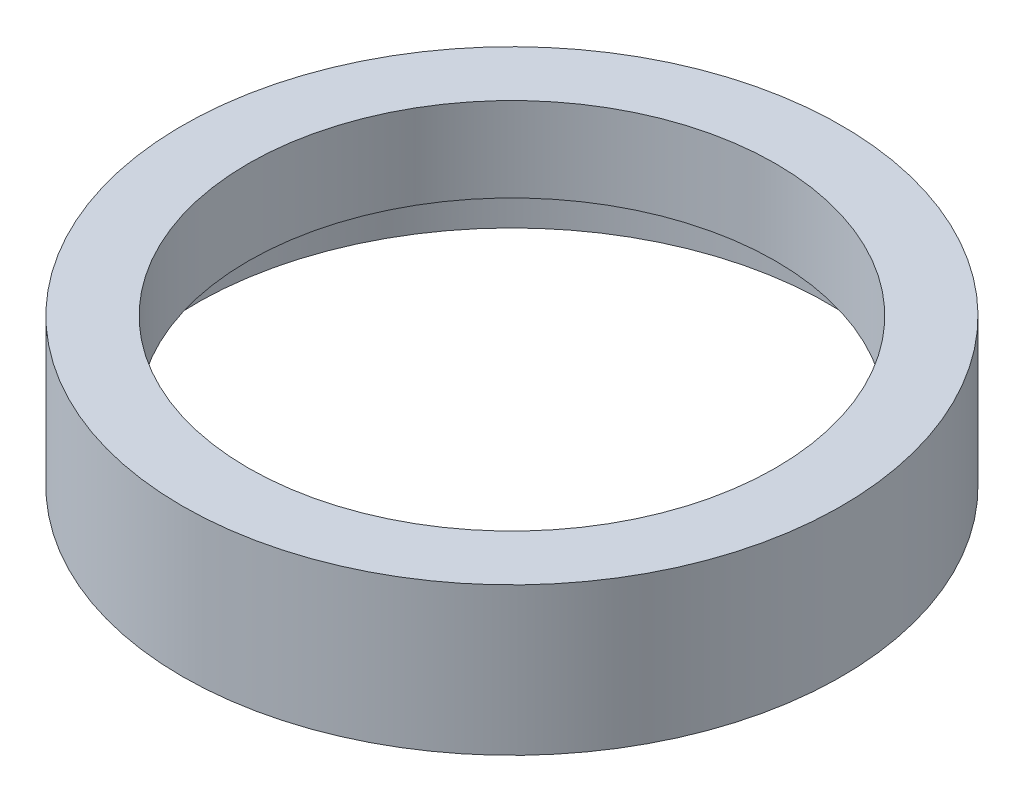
ISO-10303-21;
HEADER;
FILE_DESCRIPTION(('STEP AP214'),'2;1');
FILE_NAME('part.step','',(''),(''),'','','');
FILE_SCHEMA(('AUTOMOTIVE_DESIGN { 1 0 10303 214 1 1 1 1 }'));
ENDSEC;
DATA;
#1=APPLICATION_CONTEXT('core data for automotive mechanical design processes');
#2=APPLICATION_PROTOCOL_DEFINITION('international standard','automotive_design',2000,#1);
#3=PRODUCT_CONTEXT('',#1,'mechanical');
#4=PRODUCT('Part','Part','',(#3));
#5=PRODUCT_RELATED_PRODUCT_CATEGORY('part','',(#4));
#6=PRODUCT_DEFINITION_FORMATION('','',#4);
#7=PRODUCT_DEFINITION_CONTEXT('part definition',#1,'design');
#8=PRODUCT_DEFINITION('design','',#6,#7);
#9=PRODUCT_DEFINITION_SHAPE('','',#8);
#10=(LENGTH_UNIT() NAMED_UNIT(*) SI_UNIT(.MILLI.,.METRE.));
#11=(NAMED_UNIT(*) PLANE_ANGLE_UNIT() SI_UNIT($,.RADIAN.));
#12=(NAMED_UNIT(*) SI_UNIT($,.STERADIAN.) SOLID_ANGLE_UNIT());
#13=UNCERTAINTY_MEASURE_WITH_UNIT(LENGTH_MEASURE(1.E-05),#10,'distance_accuracy_value','');
#14=(GEOMETRIC_REPRESENTATION_CONTEXT(3) GLOBAL_UNCERTAINTY_ASSIGNED_CONTEXT((#13)) GLOBAL_UNIT_ASSIGNED_CONTEXT((#10,
#11,#12)) REPRESENTATION_CONTEXT('',''));
#15=CARTESIAN_POINT('',(0.,0.,0.));
#16=DIRECTION('',(0.,0.,1.));
#17=DIRECTION('',(1.,0.,0.));
#18=AXIS2_PLACEMENT_3D('',#15,#16,#17);
#19=CARTESIAN_POINT('',(0.,18.,0.));
#20=DIRECTION('',(0.,1.,0.));
#21=DIRECTION('',(0.,0.,1.));
#22=AXIS2_PLACEMENT_3D('',#19,#20,#21);
#23=PLANE('',#22);
#24=CARTESIAN_POINT('',(0.,18.,0.));
#25=DIRECTION('',(0.,1.,0.));
#26=DIRECTION('',(0.,0.,1.));
#27=AXIS2_PLACEMENT_3D('',#24,#25,#26);
#28=CIRCLE('',#27,60.);
#29=CARTESIAN_POINT('',(0.,18.,60.));
#30=VERTEX_POINT('',#29);
#31=EDGE_CURVE('E50',#30,#30,#28,.T.);
#32=ORIENTED_EDGE('',*,*,#31,.F.);
#33=EDGE_LOOP('',(#32));
#34=FACE_BOUND('',#33,.T.);
#35=CARTESIAN_POINT('',(0.,18.,0.));
#36=DIRECTION('',(0.,1.,0.));
#37=DIRECTION('',(0.,0.,1.));
#38=AXIS2_PLACEMENT_3D('',#35,#36,#37);
#39=CIRCLE('',#38,54.);
#40=CARTESIAN_POINT('',(0.,18.,54.));
#41=VERTEX_POINT('',#40);
#42=EDGE_CURVE('E10',#41,#41,#39,.F.);
#43=ORIENTED_EDGE('',*,*,#42,.F.);
#44=EDGE_LOOP('',(#43));
#45=FACE_BOUND('',#44,.T.);
#46=ADVANCED_FACE('F35',(#34,#45),#23,.F.);
#47=CARTESIAN_POINT('',(0.,0.,0.));
#48=DIRECTION('',(0.,1.,0.));
#49=DIRECTION('',(0.,0.,1.));
#50=AXIS2_PLACEMENT_3D('',#47,#48,#49);
#51=PLANE('',#50);
#52=CARTESIAN_POINT('',(0.,0.,0.));
#53=DIRECTION('',(0.,1.,0.));
#54=DIRECTION('',(0.,0.,1.));
#55=AXIS2_PLACEMENT_3D('',#52,#53,#54);
#56=CIRCLE('',#55,62.5);
#57=CARTESIAN_POINT('',(0.,0.,62.5));
#58=VERTEX_POINT('',#57);
#59=EDGE_CURVE('E42',#58,#58,#56,.T.);
#60=ORIENTED_EDGE('',*,*,#59,.F.);
#61=EDGE_LOOP('',(#60));
#62=FACE_BOUND('',#61,.T.);
#63=CARTESIAN_POINT('',(0.,0.,0.));
#64=DIRECTION('',(0.,1.,0.));
#65=DIRECTION('',(0.,0.,1.));
#66=AXIS2_PLACEMENT_3D('',#63,#64,#65);
#67=CIRCLE('',#66,60.);
#68=CARTESIAN_POINT('',(0.,0.,60.));
#69=VERTEX_POINT('',#68);
#70=EDGE_CURVE('E46',#69,#69,#67,.T.);
#71=ORIENTED_EDGE('',*,*,#70,.T.);
#72=EDGE_LOOP('',(#71));
#73=FACE_BOUND('',#72,.T.);
#74=ADVANCED_FACE('F85',(#62,#73),#51,.F.);
#75=CARTESIAN_POINT('',(0.,18.,0.));
#76=DIRECTION('',(0.,-1.,0.));
#77=DIRECTION('',(0.,0.,-1.));
#78=AXIS2_PLACEMENT_3D('',#75,#76,#77);
#79=CYLINDRICAL_SURFACE('',#78,62.5);
#80=ORIENTED_EDGE('',*,*,#59,.T.);
#81=EDGE_LOOP('',(#80));
#82=FACE_BOUND('',#81,.T.);
#83=CARTESIAN_POINT('',(0.,28.,0.));
#84=DIRECTION('',(0.,1.,0.));
#85=DIRECTION('',(0.,0.,1.));
#86=AXIS2_PLACEMENT_3D('',#83,#84,#85);
#87=CIRCLE('',#86,62.5);
#88=CARTESIAN_POINT('',(0.,28.,62.5));
#89=VERTEX_POINT('',#88);
#90=EDGE_CURVE('E55',#89,#89,#87,.T.);
#91=ORIENTED_EDGE('',*,*,#90,.F.);
#92=EDGE_LOOP('',(#91));
#93=FACE_BOUND('',#92,.T.);
#94=ADVANCED_FACE('F37',(#82,#93),#79,.T.);
#95=CARTESIAN_POINT('',(0.,18.,0.));
#96=DIRECTION('',(0.,-1.,0.));
#97=DIRECTION('',(0.,0.,-1.));
#98=AXIS2_PLACEMENT_3D('',#95,#96,#97);
#99=CYLINDRICAL_SURFACE('',#98,60.);
#100=ORIENTED_EDGE('',*,*,#31,.T.);
#101=EDGE_LOOP('',(#100));
#102=FACE_BOUND('',#101,.T.);
#103=ORIENTED_EDGE('',*,*,#70,.F.);
#104=EDGE_LOOP('',(#103));
#105=FACE_BOUND('',#104,.T.);
#106=ADVANCED_FACE('F96',(#102,#105),#99,.F.);
#107=CARTESIAN_POINT('',(0.,28.,0.));
#108=DIRECTION('',(0.,1.,0.));
#109=DIRECTION('',(0.,0.,1.));
#110=AXIS2_PLACEMENT_3D('',#107,#108,#109);
#111=PLANE('',#110);
#112=ORIENTED_EDGE('',*,*,#90,.T.);
#113=EDGE_LOOP('',(#112));
#114=FACE_BOUND('',#113,.T.);
#115=CARTESIAN_POINT('',(0.,28.,0.));
#116=DIRECTION('',(0.,1.,0.));
#117=DIRECTION('',(0.,0.,1.));
#118=AXIS2_PLACEMENT_3D('',#115,#116,#117);
#119=CIRCLE('',#118,50.);
#120=CARTESIAN_POINT('',(0.,28.,50.));
#121=VERTEX_POINT('',#120);
#122=EDGE_CURVE('E58',#121,#121,#119,.T.);
#123=ORIENTED_EDGE('',*,*,#122,.F.);
#124=EDGE_LOOP('',(#123));
#125=FACE_BOUND('',#124,.T.);
#126=ADVANCED_FACE('F81',(#114,#125),#111,.T.);
#127=CARTESIAN_POINT('',(0.,28.,0.));
#128=DIRECTION('',(0.,-1.,0.));
#129=DIRECTION('',(0.,0.,-1.));
#130=AXIS2_PLACEMENT_3D('',#127,#128,#129);
#131=CYLINDRICAL_SURFACE('',#130,50.);
#132=ORIENTED_EDGE('',*,*,#122,.T.);
#133=EDGE_LOOP('',(#132));
#134=FACE_BOUND('',#133,.T.);
#135=CARTESIAN_POINT('',(0.,12.,0.));
#136=DIRECTION('',(0.,-1.,0.));
#137=DIRECTION('',(0.,0.,-1.));
#138=AXIS2_PLACEMENT_3D('',#135,#136,#137);
#139=CIRCLE('',#138,50.);
#140=CARTESIAN_POINT('',(0.,12.,-50.));
#141=VERTEX_POINT('',#140);
#142=EDGE_CURVE('E64',#141,#141,#139,.T.);
#143=ORIENTED_EDGE('',*,*,#142,.T.);
#144=EDGE_LOOP('',(#143));
#145=FACE_BOUND('',#144,.T.);
#146=ADVANCED_FACE('F68',(#134,#145),#131,.F.);
#147=CARTESIAN_POINT('',(0.,12.,0.));
#148=DIRECTION('',(0.,-1.,0.));
#149=DIRECTION('',(0.,0.,-1.));
#150=AXIS2_PLACEMENT_3D('',#147,#148,#149);
#151=PLANE('',#150);
#152=CARTESIAN_POINT('',(0.,12.,0.));
#153=DIRECTION('',(0.,-1.,0.));
#154=DIRECTION('',(0.,0.,-1.));
#155=AXIS2_PLACEMENT_3D('',#152,#153,#154);
#156=CIRCLE('',#155,54.);
#157=CARTESIAN_POINT('',(0.,12.,-54.));
#158=VERTEX_POINT('',#157);
#159=EDGE_CURVE('E61',#158,#158,#156,.T.);
#160=ORIENTED_EDGE('',*,*,#159,.T.);
#161=EDGE_LOOP('',(#160));
#162=FACE_BOUND('',#161,.T.);
#163=ORIENTED_EDGE('',*,*,#142,.F.);
#164=EDGE_LOOP('',(#163));
#165=FACE_BOUND('',#164,.T.);
#166=ADVANCED_FACE('F70',(#162,#165),#151,.T.);
#167=CARTESIAN_POINT('',(0.,12.,0.));
#168=DIRECTION('',(0.,1.,0.));
#169=DIRECTION('',(0.,0.,1.));
#170=AXIS2_PLACEMENT_3D('',#167,#168,#169);
#171=CYLINDRICAL_SURFACE('',#170,54.);
#172=ORIENTED_EDGE('',*,*,#159,.F.);
#173=EDGE_LOOP('',(#172));
#174=FACE_BOUND('',#173,.T.);
#175=ORIENTED_EDGE('',*,*,#42,.T.);
#176=EDGE_LOOP('',(#175));
#177=FACE_BOUND('',#176,.T.);
#178=ADVANCED_FACE('F72',(#174,#177),#171,.T.);
#179=CLOSED_SHELL('',(#46,#74,#94,#106,#126,#146,#166,#178));
#180=MANIFOLD_SOLID_BREP('B2',#179);
#181=ADVANCED_BREP_SHAPE_REPRESENTATION('',(#18,#180),#14);
#182=SHAPE_DEFINITION_REPRESENTATION(#9,#181);
ENDSEC;
END-ISO-10303-21;
